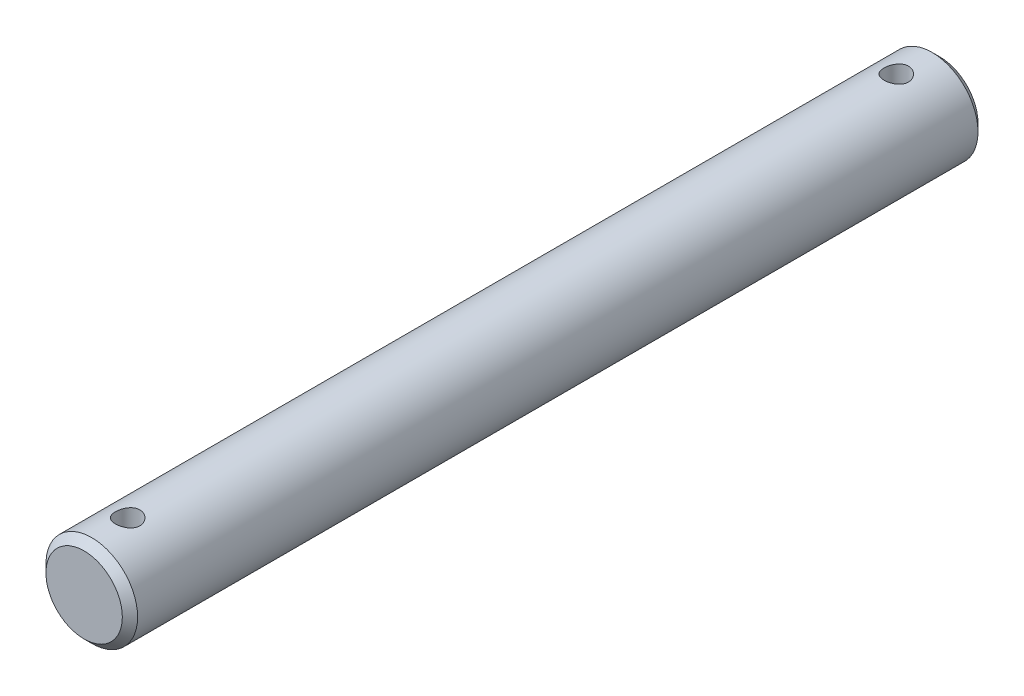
ISO-10303-21;
HEADER;
FILE_DESCRIPTION(('STEP AP214'),'2;1');
FILE_NAME('part.step','',(''),(''),'','','');
FILE_SCHEMA(('AUTOMOTIVE_DESIGN { 1 0 10303 214 1 1 1 1 }'));
ENDSEC;
DATA;
#1=APPLICATION_CONTEXT('core data for automotive mechanical design processes');
#2=APPLICATION_PROTOCOL_DEFINITION('international standard','automotive_design',2000,#1);
#3=PRODUCT_CONTEXT('',#1,'mechanical');
#4=PRODUCT('Part','Part','',(#3));
#5=PRODUCT_RELATED_PRODUCT_CATEGORY('part','',(#4));
#6=PRODUCT_DEFINITION_FORMATION('','',#4);
#7=PRODUCT_DEFINITION_CONTEXT('part definition',#1,'design');
#8=PRODUCT_DEFINITION('design','',#6,#7);
#9=PRODUCT_DEFINITION_SHAPE('','',#8);
#10=(LENGTH_UNIT() NAMED_UNIT(*) SI_UNIT(.MILLI.,.METRE.));
#11=(NAMED_UNIT(*) PLANE_ANGLE_UNIT() SI_UNIT($,.RADIAN.));
#12=(NAMED_UNIT(*) SI_UNIT($,.STERADIAN.) SOLID_ANGLE_UNIT());
#13=UNCERTAINTY_MEASURE_WITH_UNIT(LENGTH_MEASURE(1.E-05),#10,'distance_accuracy_value','');
#14=(GEOMETRIC_REPRESENTATION_CONTEXT(3) GLOBAL_UNCERTAINTY_ASSIGNED_CONTEXT((#13)) GLOBAL_UNIT_ASSIGNED_CONTEXT((#10,
#11,#12)) REPRESENTATION_CONTEXT('',''));
#15=CARTESIAN_POINT('',(0.,0.,0.));
#16=DIRECTION('',(0.,0.,1.));
#17=DIRECTION('',(1.,0.,0.));
#18=AXIS2_PLACEMENT_3D('',#15,#16,#17);
#19=CARTESIAN_POINT('',(0.,0.,28.));
#20=DIRECTION('',(0.,0.,-1.));
#21=DIRECTION('',(-1.,0.,0.));
#22=AXIS2_PLACEMENT_3D('',#19,#20,#21);
#23=CYLINDRICAL_SURFACE('',#22,3.);
#24=CARTESIAN_POINT('',(0.,-3.,25.95));
#25=CARTESIAN_POINT('',(0.0441018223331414,-2.99999933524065,25.9499989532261));
#26=CARTESIAN_POINT('',(0.0882148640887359,-2.99901794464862,25.9463409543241));
#27=CARTESIAN_POINT('',(0.175170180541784,-2.99519829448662,25.9318315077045));
#28=CARTESIAN_POINT('',(0.218011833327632,-2.99235914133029,25.9209765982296));
#29=CARTESIAN_POINT('',(0.301156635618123,-2.98513733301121,25.8924513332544));
#30=CARTESIAN_POINT('',(0.341462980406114,-2.98075666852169,25.8747897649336));
#31=CARTESIAN_POINT('',(0.418541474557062,-2.97091479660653,25.8331851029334));
#32=CARTESIAN_POINT('',(0.455313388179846,-2.96545351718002,25.8092415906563));
#33=CARTESIAN_POINT('',(0.525131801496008,-2.95389845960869,25.7551665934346));
#34=CARTESIAN_POINT('',(0.558084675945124,-2.9477938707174,25.7249165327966));
#35=CARTESIAN_POINT('',(0.618514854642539,-2.93570963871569,25.6593406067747));
#36=CARTESIAN_POINT('',(0.645991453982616,-2.92973001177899,25.6240140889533));
#37=CARTESIAN_POINT('',(0.695145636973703,-2.91846214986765,25.5485407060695));
#38=CARTESIAN_POINT('',(0.716715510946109,-2.91318755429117,25.5083214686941));
#39=CARTESIAN_POINT('',(0.752750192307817,-2.90408590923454,25.4246639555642));
#40=CARTESIAN_POINT('',(0.767216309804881,-2.9002585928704,25.3812262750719));
#41=CARTESIAN_POINT('',(0.788307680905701,-2.89459646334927,25.2934017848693));
#42=CARTESIAN_POINT('',(0.795102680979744,-2.89271859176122,25.2490585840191));
#43=CARTESIAN_POINT('',(0.801188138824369,-2.89103932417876,25.1598249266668));
#44=CARTESIAN_POINT('',(0.800479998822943,-2.89123754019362,25.1149345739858));
#45=CARTESIAN_POINT('',(0.791714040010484,-2.89364951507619,25.0272058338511));
#46=CARTESIAN_POINT('',(0.783861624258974,-2.89580694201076,24.9843451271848));
#47=CARTESIAN_POINT('',(0.761358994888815,-2.90180405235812,24.9005726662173));
#48=CARTESIAN_POINT('',(0.746708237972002,-2.90564387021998,24.8596610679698));
#49=CARTESIAN_POINT('',(0.710857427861,-2.91462264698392,24.7804127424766));
#50=CARTESIAN_POINT('',(0.68958536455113,-2.91977577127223,24.7421102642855));
#51=CARTESIAN_POINT('',(0.641146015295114,-2.93079291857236,24.6695463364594));
#52=CARTESIAN_POINT('',(0.613977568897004,-2.93665708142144,24.6352856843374));
#53=CARTESIAN_POINT('',(0.553466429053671,-2.94867004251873,24.5706044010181));
#54=CARTESIAN_POINT('',(0.519951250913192,-2.95482188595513,24.540345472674));
#55=CARTESIAN_POINT('',(0.448247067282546,-2.96654552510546,24.4858444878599));
#56=CARTESIAN_POINT('',(0.410057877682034,-2.97211729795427,24.461602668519));
#57=CARTESIAN_POINT('',(0.329839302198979,-2.98208728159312,24.4197528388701));
#58=CARTESIAN_POINT('',(0.287793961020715,-2.98648029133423,24.4021740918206));
#59=CARTESIAN_POINT('',(0.201200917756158,-2.99356017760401,24.3743811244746));
#60=CARTESIAN_POINT('',(0.156653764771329,-2.99624742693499,24.3641652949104));
#61=CARTESIAN_POINT('',(0.0677016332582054,-2.99955663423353,24.3516420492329));
#62=CARTESIAN_POINT('',(0.0233296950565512,-3.00023598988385,24.3491147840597));
#63=CARTESIAN_POINT('',(-0.0652040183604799,-2.99961788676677,24.3514332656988));
#64=CARTESIAN_POINT('',(-0.109365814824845,-2.99832063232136,24.3562782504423));
#65=CARTESIAN_POINT('',(-0.195440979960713,-2.99393214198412,24.373023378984));
#66=CARTESIAN_POINT('',(-0.237379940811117,-2.99087210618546,24.3848008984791));
#67=CARTESIAN_POINT('',(-0.318682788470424,-2.98330517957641,24.4149343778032));
#68=CARTESIAN_POINT('',(-0.3580463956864,-2.97879813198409,24.4332910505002));
#69=CARTESIAN_POINT('',(-0.433935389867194,-2.96870264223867,24.4764695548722));
#70=CARTESIAN_POINT('',(-0.47039007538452,-2.96309474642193,24.5014109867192));
#71=CARTESIAN_POINT('',(-0.538673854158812,-2.95144580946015,24.5569006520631));
#72=CARTESIAN_POINT('',(-0.570502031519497,-2.94540468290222,24.5874499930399));
#73=CARTESIAN_POINT('',(-0.629555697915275,-2.9333589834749,24.6543142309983));
#74=CARTESIAN_POINT('',(-0.656626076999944,-2.92736024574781,24.6907674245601));
#75=CARTESIAN_POINT('',(-0.704268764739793,-2.91626578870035,24.7678258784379));
#76=CARTESIAN_POINT('',(-0.724841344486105,-2.91117003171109,24.8084309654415));
#77=CARTESIAN_POINT('',(-0.758749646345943,-2.9025170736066,24.8924381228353));
#78=CARTESIAN_POINT('',(-0.772127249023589,-2.89895099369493,24.9358223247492));
#79=CARTESIAN_POINT('',(-0.791364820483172,-2.89375930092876,25.0243357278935));
#80=CARTESIAN_POINT('',(-0.797226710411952,-2.89213319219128,25.0694644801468));
#81=CARTESIAN_POINT('',(-0.801155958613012,-2.89104697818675,25.158597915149));
#82=CARTESIAN_POINT('',(-0.79947262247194,-2.89151759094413,25.2025909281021));
#83=CARTESIAN_POINT('',(-0.788937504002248,-2.89440958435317,25.2896414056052));
#84=CARTESIAN_POINT('',(-0.780085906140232,-2.89683091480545,25.3326988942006));
#85=CARTESIAN_POINT('',(-0.755610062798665,-2.90331028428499,25.4163423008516));
#86=CARTESIAN_POINT('',(-0.740038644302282,-2.90735554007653,25.4569447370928));
#87=CARTESIAN_POINT('',(-0.702606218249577,-2.91662727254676,25.5349915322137));
#88=CARTESIAN_POINT('',(-0.680744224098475,-2.92185393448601,25.5724353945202));
#89=CARTESIAN_POINT('',(-0.630595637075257,-2.93309168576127,25.6442921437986));
#90=CARTESIAN_POINT('',(-0.602138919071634,-2.93912133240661,25.6785834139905));
#91=CARTESIAN_POINT('',(-0.539932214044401,-2.95118201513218,25.7419849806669));
#92=CARTESIAN_POINT('',(-0.506180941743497,-2.9572130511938,25.7710940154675));
#93=CARTESIAN_POINT('',(-0.433471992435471,-2.96875124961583,25.8239168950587));
#94=CARTESIAN_POINT('',(-0.39441838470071,-2.97424444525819,25.8475020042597));
#95=CARTESIAN_POINT('',(-0.312755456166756,-2.9839352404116,25.8877349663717));
#96=CARTESIAN_POINT('',(-0.270148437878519,-2.98813367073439,25.9043872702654));
#97=CARTESIAN_POINT('',(-0.189749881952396,-2.99421901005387,25.9281101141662));
#98=CARTESIAN_POINT('',(-0.152304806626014,-2.99637108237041,25.936299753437));
#99=CARTESIAN_POINT('',(-0.0765759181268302,-2.99926179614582,25.9472448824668));
#100=CARTESIAN_POINT('',(-0.0382921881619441,-3.00000057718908,25.95000090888));
#101=CARTESIAN_POINT('',(0.,-3.,25.95));
#102=B_SPLINE_CURVE_WITH_KNOTS('',3,(#24,#25,#26,#27,#28,#29,#30,#31,#32,#33,#34,#35,#36,#37,
#38,#39,#40,#41,#42,#43,#44,#45,#46,#47,#48,#49,#50,#51,#52,#53,#54,#55,#56,#57,#58,#59,#60,#61,
#62,#63,#64,#65,#66,#67,#68,#69,#70,#71,#72,#73,#74,#75,#76,#77,#78,#79,#80,#81,#82,#83,#84,#85,
#86,#87,#88,#89,#90,#91,#92,#93,#94,#95,#96,#97,#98,#99,#100,#101),.UNSPECIFIED.,.T.,.F.,(4,2,2,
2,2,2,2,2,2,2,2,2,2,2,2,2,2,2,2,2,2,2,2,2,2,2,2,2,2,2,2,2,2,2,2,2,2,2,4),(0.,0.132165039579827,
0.264393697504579,0.396452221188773,0.528519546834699,0.663339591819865,0.798176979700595,
0.935330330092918,1.0724583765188,1.20648863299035,1.34049384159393,1.47076400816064,
1.60104458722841,1.73279469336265,1.86457075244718,2.00064503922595,2.13672468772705,
2.27339523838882,2.41003590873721,2.54273087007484,2.67541211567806,2.80581414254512,
2.93623030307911,3.06920114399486,3.2021982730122,3.33894598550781,3.47568799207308,
3.61162519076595,3.7475276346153,3.87897336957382,4.01041572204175,4.14084306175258,
4.27129086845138,4.40557735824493,4.53989649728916,4.67708900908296,4.81419330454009,
4.92895927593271,5.0437139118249),.UNSPECIFIED.);
#103=CARTESIAN_POINT('',(0.,-3.,25.95));
#104=VERTEX_POINT('',#103);
#105=EDGE_CURVE('E10',#104,#104,#102,.T.);
#106=ORIENTED_EDGE('',*,*,#105,.T.);
#107=EDGE_LOOP('',(#106));
#108=FACE_BOUND('',#107,.T.);
#109=CARTESIAN_POINT('',(0.,3.,25.95));
#110=CARTESIAN_POINT('',(-0.0441018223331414,2.99999933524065,25.9499989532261));
#111=CARTESIAN_POINT('',(-0.0882148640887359,2.99901794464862,25.9463409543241));
#112=CARTESIAN_POINT('',(-0.175170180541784,2.99519829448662,25.9318315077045));
#113=CARTESIAN_POINT('',(-0.218011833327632,2.99235914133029,25.9209765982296));
#114=CARTESIAN_POINT('',(-0.301156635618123,2.98513733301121,25.8924513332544));
#115=CARTESIAN_POINT('',(-0.341462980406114,2.98075666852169,25.8747897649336));
#116=CARTESIAN_POINT('',(-0.418541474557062,2.97091479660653,25.8331851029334));
#117=CARTESIAN_POINT('',(-0.455313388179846,2.96545351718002,25.8092415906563));
#118=CARTESIAN_POINT('',(-0.525131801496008,2.95389845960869,25.7551665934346));
#119=CARTESIAN_POINT('',(-0.558084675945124,2.9477938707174,25.7249165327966));
#120=CARTESIAN_POINT('',(-0.618514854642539,2.93570963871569,25.6593406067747));
#121=CARTESIAN_POINT('',(-0.645991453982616,2.92973001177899,25.6240140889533));
#122=CARTESIAN_POINT('',(-0.695145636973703,2.91846214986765,25.5485407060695));
#123=CARTESIAN_POINT('',(-0.716715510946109,2.91318755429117,25.5083214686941));
#124=CARTESIAN_POINT('',(-0.752750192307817,2.90408590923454,25.4246639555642));
#125=CARTESIAN_POINT('',(-0.767216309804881,2.9002585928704,25.3812262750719));
#126=CARTESIAN_POINT('',(-0.788307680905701,2.89459646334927,25.2934017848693));
#127=CARTESIAN_POINT('',(-0.795102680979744,2.89271859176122,25.2490585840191));
#128=CARTESIAN_POINT('',(-0.801188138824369,2.89103932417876,25.1598249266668));
#129=CARTESIAN_POINT('',(-0.800479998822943,2.89123754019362,25.1149345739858));
#130=CARTESIAN_POINT('',(-0.791714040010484,2.89364951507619,25.0272058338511));
#131=CARTESIAN_POINT('',(-0.783861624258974,2.89580694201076,24.9843451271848));
#132=CARTESIAN_POINT('',(-0.761358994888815,2.90180405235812,24.9005726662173));
#133=CARTESIAN_POINT('',(-0.746708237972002,2.90564387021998,24.8596610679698));
#134=CARTESIAN_POINT('',(-0.710857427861,2.91462264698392,24.7804127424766));
#135=CARTESIAN_POINT('',(-0.68958536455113,2.91977577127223,24.7421102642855));
#136=CARTESIAN_POINT('',(-0.641146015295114,2.93079291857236,24.6695463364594));
#137=CARTESIAN_POINT('',(-0.613977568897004,2.93665708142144,24.6352856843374));
#138=CARTESIAN_POINT('',(-0.553466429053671,2.94867004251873,24.5706044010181));
#139=CARTESIAN_POINT('',(-0.519951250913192,2.95482188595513,24.540345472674));
#140=CARTESIAN_POINT('',(-0.448247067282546,2.96654552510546,24.4858444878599));
#141=CARTESIAN_POINT('',(-0.410057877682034,2.97211729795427,24.461602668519));
#142=CARTESIAN_POINT('',(-0.329839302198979,2.98208728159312,24.4197528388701));
#143=CARTESIAN_POINT('',(-0.287793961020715,2.98648029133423,24.4021740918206));
#144=CARTESIAN_POINT('',(-0.201200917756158,2.99356017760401,24.3743811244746));
#145=CARTESIAN_POINT('',(-0.156653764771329,2.99624742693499,24.3641652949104));
#146=CARTESIAN_POINT('',(-0.0677016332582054,2.99955663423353,24.3516420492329));
#147=CARTESIAN_POINT('',(-0.0233296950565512,3.00023598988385,24.3491147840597));
#148=CARTESIAN_POINT('',(0.0652040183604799,2.99961788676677,24.3514332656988));
#149=CARTESIAN_POINT('',(0.109365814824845,2.99832063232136,24.3562782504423));
#150=CARTESIAN_POINT('',(0.195440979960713,2.99393214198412,24.373023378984));
#151=CARTESIAN_POINT('',(0.237379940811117,2.99087210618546,24.3848008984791));
#152=CARTESIAN_POINT('',(0.318682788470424,2.98330517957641,24.4149343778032));
#153=CARTESIAN_POINT('',(0.3580463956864,2.97879813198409,24.4332910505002));
#154=CARTESIAN_POINT('',(0.433935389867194,2.96870264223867,24.4764695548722));
#155=CARTESIAN_POINT('',(0.47039007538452,2.96309474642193,24.5014109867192));
#156=CARTESIAN_POINT('',(0.538673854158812,2.95144580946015,24.5569006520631));
#157=CARTESIAN_POINT('',(0.570502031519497,2.94540468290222,24.5874499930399));
#158=CARTESIAN_POINT('',(0.629555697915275,2.9333589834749,24.6543142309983));
#159=CARTESIAN_POINT('',(0.656626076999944,2.92736024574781,24.6907674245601));
#160=CARTESIAN_POINT('',(0.704268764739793,2.91626578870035,24.7678258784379));
#161=CARTESIAN_POINT('',(0.724841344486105,2.91117003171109,24.8084309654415));
#162=CARTESIAN_POINT('',(0.758749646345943,2.9025170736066,24.8924381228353));
#163=CARTESIAN_POINT('',(0.772127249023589,2.89895099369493,24.9358223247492));
#164=CARTESIAN_POINT('',(0.791364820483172,2.89375930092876,25.0243357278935));
#165=CARTESIAN_POINT('',(0.797226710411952,2.89213319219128,25.0694644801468));
#166=CARTESIAN_POINT('',(0.801155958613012,2.89104697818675,25.158597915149));
#167=CARTESIAN_POINT('',(0.79947262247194,2.89151759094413,25.2025909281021));
#168=CARTESIAN_POINT('',(0.788937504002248,2.89440958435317,25.2896414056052));
#169=CARTESIAN_POINT('',(0.780085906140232,2.89683091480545,25.3326988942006));
#170=CARTESIAN_POINT('',(0.755610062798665,2.90331028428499,25.4163423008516));
#171=CARTESIAN_POINT('',(0.740038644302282,2.90735554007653,25.4569447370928));
#172=CARTESIAN_POINT('',(0.702606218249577,2.91662727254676,25.5349915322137));
#173=CARTESIAN_POINT('',(0.680744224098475,2.92185393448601,25.5724353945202));
#174=CARTESIAN_POINT('',(0.630595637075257,2.93309168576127,25.6442921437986));
#175=CARTESIAN_POINT('',(0.602138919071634,2.93912133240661,25.6785834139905));
#176=CARTESIAN_POINT('',(0.539932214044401,2.95118201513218,25.7419849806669));
#177=CARTESIAN_POINT('',(0.506180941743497,2.9572130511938,25.7710940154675));
#178=CARTESIAN_POINT('',(0.433471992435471,2.96875124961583,25.8239168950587));
#179=CARTESIAN_POINT('',(0.39441838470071,2.97424444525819,25.8475020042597));
#180=CARTESIAN_POINT('',(0.312755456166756,2.9839352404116,25.8877349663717));
#181=CARTESIAN_POINT('',(0.270148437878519,2.98813367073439,25.9043872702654));
#182=CARTESIAN_POINT('',(0.189749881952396,2.99421901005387,25.9281101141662));
#183=CARTESIAN_POINT('',(0.152304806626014,2.99637108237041,25.936299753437));
#184=CARTESIAN_POINT('',(0.0765759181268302,2.99926179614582,25.9472448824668));
#185=CARTESIAN_POINT('',(0.0382921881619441,3.00000057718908,25.95000090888));
#186=CARTESIAN_POINT('',(0.,3.,25.95));
#187=B_SPLINE_CURVE_WITH_KNOTS('',3,(#109,#110,#111,#112,#113,#114,#115,#116,#117,#118,#119,
#120,#121,#122,#123,#124,#125,#126,#127,#128,#129,#130,#131,#132,#133,#134,#135,#136,#137,#138,
#139,#140,#141,#142,#143,#144,#145,#146,#147,#148,#149,#150,#151,#152,#153,#154,#155,#156,#157,
#158,#159,#160,#161,#162,#163,#164,#165,#166,#167,#168,#169,#170,#171,#172,#173,#174,#175,#176,
#177,#178,#179,#180,#181,#182,#183,#184,#185,#186),.UNSPECIFIED.,.T.,.F.,(4,2,2,2,2,2,2,2,2,2,2,
2,2,2,2,2,2,2,2,2,2,2,2,2,2,2,2,2,2,2,2,2,2,2,2,2,2,2,4),(0.,0.132165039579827,
0.264393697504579,0.396452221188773,0.528519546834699,0.663339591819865,0.798176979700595,
0.935330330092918,1.0724583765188,1.20648863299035,1.34049384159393,1.47076400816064,
1.60104458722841,1.73279469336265,1.86457075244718,2.00064503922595,2.13672468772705,
2.27339523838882,2.41003590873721,2.54273087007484,2.67541211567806,2.80581414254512,
2.93623030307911,3.06920114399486,3.2021982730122,3.33894598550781,3.47568799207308,
3.61162519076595,3.7475276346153,3.87897336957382,4.01041572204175,4.14084306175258,
4.27129086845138,4.40557735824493,4.53989649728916,4.67708900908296,4.81419330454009,
4.92895927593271,5.0437139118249),.UNSPECIFIED.);
#188=CARTESIAN_POINT('',(0.,3.,25.95));
#189=VERTEX_POINT('',#188);
#190=EDGE_CURVE('E41',#189,#189,#187,.T.);
#191=ORIENTED_EDGE('',*,*,#190,.T.);
#192=EDGE_LOOP('',(#191));
#193=FACE_BOUND('',#192,.T.);
#194=CARTESIAN_POINT('',(0.,-3.,-24.35));
#195=CARTESIAN_POINT('',(0.0441018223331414,-2.99999933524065,-24.3500010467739));
#196=CARTESIAN_POINT('',(0.0882148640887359,-2.99901794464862,-24.3536590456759));
#197=CARTESIAN_POINT('',(0.175170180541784,-2.99519829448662,-24.3681684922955));
#198=CARTESIAN_POINT('',(0.218011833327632,-2.99235914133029,-24.3790234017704));
#199=CARTESIAN_POINT('',(0.301156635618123,-2.98513733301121,-24.4075486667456));
#200=CARTESIAN_POINT('',(0.341462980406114,-2.98075666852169,-24.4252102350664));
#201=CARTESIAN_POINT('',(0.418541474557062,-2.97091479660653,-24.4668148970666));
#202=CARTESIAN_POINT('',(0.455313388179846,-2.96545351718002,-24.4907584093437));
#203=CARTESIAN_POINT('',(0.525131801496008,-2.95389845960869,-24.5448334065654));
#204=CARTESIAN_POINT('',(0.558084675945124,-2.9477938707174,-24.5750834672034));
#205=CARTESIAN_POINT('',(0.618514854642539,-2.93570963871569,-24.6406593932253));
#206=CARTESIAN_POINT('',(0.645991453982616,-2.92973001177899,-24.6759859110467));
#207=CARTESIAN_POINT('',(0.695145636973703,-2.91846214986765,-24.7514592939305));
#208=CARTESIAN_POINT('',(0.716715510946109,-2.91318755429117,-24.7916785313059));
#209=CARTESIAN_POINT('',(0.752750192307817,-2.90408590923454,-24.8753360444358));
#210=CARTESIAN_POINT('',(0.767216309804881,-2.9002585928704,-24.9187737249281));
#211=CARTESIAN_POINT('',(0.788307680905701,-2.89459646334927,-25.0065982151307));
#212=CARTESIAN_POINT('',(0.795102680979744,-2.89271859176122,-25.0509414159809));
#213=CARTESIAN_POINT('',(0.801188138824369,-2.89103932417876,-25.1401750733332));
#214=CARTESIAN_POINT('',(0.800479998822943,-2.89123754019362,-25.1850654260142));
#215=CARTESIAN_POINT('',(0.791714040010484,-2.89364951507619,-25.2727941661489));
#216=CARTESIAN_POINT('',(0.783861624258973,-2.89580694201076,-25.3156548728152));
#217=CARTESIAN_POINT('',(0.761358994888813,-2.90180405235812,-25.3994273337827));
#218=CARTESIAN_POINT('',(0.746708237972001,-2.90564387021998,-25.4403389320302));
#219=CARTESIAN_POINT('',(0.710857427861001,-2.91462264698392,-25.5195872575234));
#220=CARTESIAN_POINT('',(0.68958536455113,-2.91977577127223,-25.5578897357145));
#221=CARTESIAN_POINT('',(0.641146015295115,-2.93079291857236,-25.6304536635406));
#222=CARTESIAN_POINT('',(0.613977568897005,-2.93665708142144,-25.6647143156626));
#223=CARTESIAN_POINT('',(0.553466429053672,-2.94867004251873,-25.7293955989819));
#224=CARTESIAN_POINT('',(0.519951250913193,-2.95482188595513,-25.759654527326));
#225=CARTESIAN_POINT('',(0.448247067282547,-2.96654552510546,-25.8141555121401));
#226=CARTESIAN_POINT('',(0.410057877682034,-2.97211729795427,-25.838397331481));
#227=CARTESIAN_POINT('',(0.329839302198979,-2.98208728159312,-25.8802471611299));
#228=CARTESIAN_POINT('',(0.287793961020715,-2.98648029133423,-25.8978259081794));
#229=CARTESIAN_POINT('',(0.201200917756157,-2.99356017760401,-25.9256188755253));
#230=CARTESIAN_POINT('',(0.156653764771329,-2.99624742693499,-25.9358347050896));
#231=CARTESIAN_POINT('',(0.0677016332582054,-2.99955663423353,-25.9483579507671));
#232=CARTESIAN_POINT('',(0.0233296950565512,-3.00023598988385,-25.9508852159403));
#233=CARTESIAN_POINT('',(-0.0652040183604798,-2.99961788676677,-25.9485667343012));
#234=CARTESIAN_POINT('',(-0.109365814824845,-2.99832063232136,-25.9437217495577));
#235=CARTESIAN_POINT('',(-0.195440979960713,-2.99393214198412,-25.926976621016));
#236=CARTESIAN_POINT('',(-0.237379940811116,-2.99087210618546,-25.9151991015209));
#237=CARTESIAN_POINT('',(-0.318682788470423,-2.98330517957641,-25.8850656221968));
#238=CARTESIAN_POINT('',(-0.3580463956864,-2.97879813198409,-25.8667089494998));
#239=CARTESIAN_POINT('',(-0.433935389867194,-2.96870264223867,-25.8235304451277));
#240=CARTESIAN_POINT('',(-0.47039007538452,-2.96309474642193,-25.7985890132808));
#241=CARTESIAN_POINT('',(-0.538673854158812,-2.95144580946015,-25.7430993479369));
#242=CARTESIAN_POINT('',(-0.570502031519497,-2.94540468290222,-25.7125500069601));
#243=CARTESIAN_POINT('',(-0.629555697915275,-2.9333589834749,-25.6456857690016));
#244=CARTESIAN_POINT('',(-0.656626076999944,-2.92736024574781,-25.6092325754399));
#245=CARTESIAN_POINT('',(-0.704268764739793,-2.91626578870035,-25.5321741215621));
#246=CARTESIAN_POINT('',(-0.724841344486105,-2.91117003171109,-25.4915690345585));
#247=CARTESIAN_POINT('',(-0.758749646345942,-2.9025170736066,-25.4075618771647));
#248=CARTESIAN_POINT('',(-0.772127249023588,-2.89895099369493,-25.3641776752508));
#249=CARTESIAN_POINT('',(-0.791364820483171,-2.89375930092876,-25.2756642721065));
#250=CARTESIAN_POINT('',(-0.797226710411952,-2.89213319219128,-25.2305355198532));
#251=CARTESIAN_POINT('',(-0.801155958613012,-2.89104697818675,-25.141402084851));
#252=CARTESIAN_POINT('',(-0.799472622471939,-2.89151759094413,-25.0974090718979));
#253=CARTESIAN_POINT('',(-0.788937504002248,-2.89440958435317,-25.0103585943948));
#254=CARTESIAN_POINT('',(-0.780085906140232,-2.89683091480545,-24.9673011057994));
#255=CARTESIAN_POINT('',(-0.755610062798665,-2.90331028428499,-24.8836576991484));
#256=CARTESIAN_POINT('',(-0.740038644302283,-2.90735554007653,-24.8430552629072));
#257=CARTESIAN_POINT('',(-0.702606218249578,-2.91662727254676,-24.7650084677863));
#258=CARTESIAN_POINT('',(-0.680744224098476,-2.92185393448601,-24.7275646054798));
#259=CARTESIAN_POINT('',(-0.630595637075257,-2.93309168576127,-24.6557078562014));
#260=CARTESIAN_POINT('',(-0.602138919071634,-2.93912133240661,-24.6214165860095));
#261=CARTESIAN_POINT('',(-0.539932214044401,-2.95118201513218,-24.5580150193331));
#262=CARTESIAN_POINT('',(-0.506180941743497,-2.9572130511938,-24.5289059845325));
#263=CARTESIAN_POINT('',(-0.433471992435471,-2.96875124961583,-24.4760831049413));
#264=CARTESIAN_POINT('',(-0.39441838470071,-2.97424444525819,-24.4524979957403));
#265=CARTESIAN_POINT('',(-0.312755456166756,-2.9839352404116,-24.4122650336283));
#266=CARTESIAN_POINT('',(-0.270148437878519,-2.98813367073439,-24.3956127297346));
#267=CARTESIAN_POINT('',(-0.189749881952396,-2.99421901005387,-24.3718898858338));
#268=CARTESIAN_POINT('',(-0.152304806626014,-2.99637108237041,-24.363700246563));
#269=CARTESIAN_POINT('',(-0.0765759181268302,-2.99926179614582,-24.3527551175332));
#270=CARTESIAN_POINT('',(-0.0382921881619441,-3.00000057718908,-24.34999909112));
#271=CARTESIAN_POINT('',(0.,-3.,-24.35));
#272=B_SPLINE_CURVE_WITH_KNOTS('',3,(#194,#195,#196,#197,#198,#199,#200,#201,#202,#203,#204,
#205,#206,#207,#208,#209,#210,#211,#212,#213,#214,#215,#216,#217,#218,#219,#220,#221,#222,#223,
#224,#225,#226,#227,#228,#229,#230,#231,#232,#233,#234,#235,#236,#237,#238,#239,#240,#241,#242,
#243,#244,#245,#246,#247,#248,#249,#250,#251,#252,#253,#254,#255,#256,#257,#258,#259,#260,#261,
#262,#263,#264,#265,#266,#267,#268,#269,#270,#271),.UNSPECIFIED.,.T.,.F.,(4,2,2,2,2,2,2,2,2,2,2,
2,2,2,2,2,2,2,2,2,2,2,2,2,2,2,2,2,2,2,2,2,2,2,2,2,2,2,4),(0.,0.132165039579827,
0.264393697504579,0.396452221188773,0.528519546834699,0.663339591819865,0.798176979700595,
0.935330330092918,1.0724583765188,1.20648863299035,1.34049384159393,1.47076400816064,
1.60104458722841,1.73279469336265,1.86457075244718,2.00064503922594,2.13672468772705,
2.27339523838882,2.41003590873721,2.54273087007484,2.67541211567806,2.80581414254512,
2.93623030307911,3.06920114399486,3.2021982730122,3.33894598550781,3.47568799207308,
3.61162519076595,3.7475276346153,3.87897336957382,4.01041572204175,4.14084306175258,
4.27129086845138,4.40557735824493,4.53989649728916,4.67708900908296,4.81419330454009,
4.92895927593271,5.0437139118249),.UNSPECIFIED.);
#273=CARTESIAN_POINT('',(0.,-3.,-24.35));
#274=VERTEX_POINT('',#273);
#275=EDGE_CURVE('E45',#274,#274,#272,.T.);
#276=ORIENTED_EDGE('',*,*,#275,.T.);
#277=EDGE_LOOP('',(#276));
#278=FACE_BOUND('',#277,.T.);
#279=CARTESIAN_POINT('',(0.,3.,-24.35));
#280=CARTESIAN_POINT('',(-0.0441018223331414,2.99999933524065,-24.3500010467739));
#281=CARTESIAN_POINT('',(-0.0882148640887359,2.99901794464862,-24.3536590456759));
#282=CARTESIAN_POINT('',(-0.175170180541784,2.99519829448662,-24.3681684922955));
#283=CARTESIAN_POINT('',(-0.218011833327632,2.99235914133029,-24.3790234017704));
#284=CARTESIAN_POINT('',(-0.301156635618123,2.98513733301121,-24.4075486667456));
#285=CARTESIAN_POINT('',(-0.341462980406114,2.98075666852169,-24.4252102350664));
#286=CARTESIAN_POINT('',(-0.418541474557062,2.97091479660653,-24.4668148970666));
#287=CARTESIAN_POINT('',(-0.455313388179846,2.96545351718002,-24.4907584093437));
#288=CARTESIAN_POINT('',(-0.525131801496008,2.95389845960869,-24.5448334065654));
#289=CARTESIAN_POINT('',(-0.558084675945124,2.9477938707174,-24.5750834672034));
#290=CARTESIAN_POINT('',(-0.618514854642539,2.93570963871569,-24.6406593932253));
#291=CARTESIAN_POINT('',(-0.645991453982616,2.92973001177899,-24.6759859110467));
#292=CARTESIAN_POINT('',(-0.695145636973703,2.91846214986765,-24.7514592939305));
#293=CARTESIAN_POINT('',(-0.716715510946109,2.91318755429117,-24.7916785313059));
#294=CARTESIAN_POINT('',(-0.752750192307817,2.90408590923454,-24.8753360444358));
#295=CARTESIAN_POINT('',(-0.767216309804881,2.9002585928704,-24.9187737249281));
#296=CARTESIAN_POINT('',(-0.788307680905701,2.89459646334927,-25.0065982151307));
#297=CARTESIAN_POINT('',(-0.795102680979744,2.89271859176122,-25.0509414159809));
#298=CARTESIAN_POINT('',(-0.801188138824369,2.89103932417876,-25.1401750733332));
#299=CARTESIAN_POINT('',(-0.800479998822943,2.89123754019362,-25.1850654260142));
#300=CARTESIAN_POINT('',(-0.791714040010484,2.89364951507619,-25.2727941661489));
#301=CARTESIAN_POINT('',(-0.783861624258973,2.89580694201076,-25.3156548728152));
#302=CARTESIAN_POINT('',(-0.761358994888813,2.90180405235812,-25.3994273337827));
#303=CARTESIAN_POINT('',(-0.746708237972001,2.90564387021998,-25.4403389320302));
#304=CARTESIAN_POINT('',(-0.710857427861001,2.91462264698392,-25.5195872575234));
#305=CARTESIAN_POINT('',(-0.68958536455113,2.91977577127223,-25.5578897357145));
#306=CARTESIAN_POINT('',(-0.641146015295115,2.93079291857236,-25.6304536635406));
#307=CARTESIAN_POINT('',(-0.613977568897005,2.93665708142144,-25.6647143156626));
#308=CARTESIAN_POINT('',(-0.553466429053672,2.94867004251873,-25.7293955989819));
#309=CARTESIAN_POINT('',(-0.519951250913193,2.95482188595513,-25.759654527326));
#310=CARTESIAN_POINT('',(-0.448247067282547,2.96654552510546,-25.8141555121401));
#311=CARTESIAN_POINT('',(-0.410057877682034,2.97211729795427,-25.838397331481));
#312=CARTESIAN_POINT('',(-0.329839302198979,2.98208728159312,-25.8802471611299));
#313=CARTESIAN_POINT('',(-0.287793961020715,2.98648029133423,-25.8978259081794));
#314=CARTESIAN_POINT('',(-0.201200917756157,2.99356017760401,-25.9256188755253));
#315=CARTESIAN_POINT('',(-0.156653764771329,2.99624742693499,-25.9358347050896));
#316=CARTESIAN_POINT('',(-0.0677016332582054,2.99955663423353,-25.9483579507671));
#317=CARTESIAN_POINT('',(-0.0233296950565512,3.00023598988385,-25.9508852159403));
#318=CARTESIAN_POINT('',(0.0652040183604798,2.99961788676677,-25.9485667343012));
#319=CARTESIAN_POINT('',(0.109365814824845,2.99832063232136,-25.9437217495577));
#320=CARTESIAN_POINT('',(0.195440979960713,2.99393214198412,-25.926976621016));
#321=CARTESIAN_POINT('',(0.237379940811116,2.99087210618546,-25.9151991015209));
#322=CARTESIAN_POINT('',(0.318682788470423,2.98330517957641,-25.8850656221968));
#323=CARTESIAN_POINT('',(0.3580463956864,2.97879813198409,-25.8667089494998));
#324=CARTESIAN_POINT('',(0.433935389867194,2.96870264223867,-25.8235304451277));
#325=CARTESIAN_POINT('',(0.47039007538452,2.96309474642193,-25.7985890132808));
#326=CARTESIAN_POINT('',(0.538673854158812,2.95144580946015,-25.7430993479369));
#327=CARTESIAN_POINT('',(0.570502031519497,2.94540468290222,-25.7125500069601));
#328=CARTESIAN_POINT('',(0.629555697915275,2.9333589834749,-25.6456857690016));
#329=CARTESIAN_POINT('',(0.656626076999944,2.92736024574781,-25.6092325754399));
#330=CARTESIAN_POINT('',(0.704268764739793,2.91626578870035,-25.5321741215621));
#331=CARTESIAN_POINT('',(0.724841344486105,2.91117003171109,-25.4915690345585));
#332=CARTESIAN_POINT('',(0.758749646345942,2.9025170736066,-25.4075618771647));
#333=CARTESIAN_POINT('',(0.772127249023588,2.89895099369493,-25.3641776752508));
#334=CARTESIAN_POINT('',(0.791364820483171,2.89375930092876,-25.2756642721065));
#335=CARTESIAN_POINT('',(0.797226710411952,2.89213319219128,-25.2305355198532));
#336=CARTESIAN_POINT('',(0.801155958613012,2.89104697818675,-25.141402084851));
#337=CARTESIAN_POINT('',(0.799472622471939,2.89151759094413,-25.0974090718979));
#338=CARTESIAN_POINT('',(0.788937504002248,2.89440958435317,-25.0103585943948));
#339=CARTESIAN_POINT('',(0.780085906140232,2.89683091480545,-24.9673011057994));
#340=CARTESIAN_POINT('',(0.755610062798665,2.90331028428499,-24.8836576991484));
#341=CARTESIAN_POINT('',(0.740038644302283,2.90735554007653,-24.8430552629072));
#342=CARTESIAN_POINT('',(0.702606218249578,2.91662727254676,-24.7650084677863));
#343=CARTESIAN_POINT('',(0.680744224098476,2.92185393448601,-24.7275646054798));
#344=CARTESIAN_POINT('',(0.630595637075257,2.93309168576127,-24.6557078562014));
#345=CARTESIAN_POINT('',(0.602138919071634,2.93912133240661,-24.6214165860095));
#346=CARTESIAN_POINT('',(0.539932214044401,2.95118201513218,-24.5580150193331));
#347=CARTESIAN_POINT('',(0.506180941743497,2.9572130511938,-24.5289059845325));
#348=CARTESIAN_POINT('',(0.433471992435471,2.96875124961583,-24.4760831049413));
#349=CARTESIAN_POINT('',(0.39441838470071,2.97424444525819,-24.4524979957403));
#350=CARTESIAN_POINT('',(0.312755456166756,2.9839352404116,-24.4122650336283));
#351=CARTESIAN_POINT('',(0.270148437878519,2.98813367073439,-24.3956127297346));
#352=CARTESIAN_POINT('',(0.189749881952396,2.99421901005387,-24.3718898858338));
#353=CARTESIAN_POINT('',(0.152304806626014,2.99637108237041,-24.363700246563));
#354=CARTESIAN_POINT('',(0.0765759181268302,2.99926179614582,-24.3527551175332));
#355=CARTESIAN_POINT('',(0.0382921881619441,3.00000057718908,-24.34999909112));
#356=CARTESIAN_POINT('',(0.,3.,-24.35));
#357=B_SPLINE_CURVE_WITH_KNOTS('',3,(#279,#280,#281,#282,#283,#284,#285,#286,#287,#288,#289,
#290,#291,#292,#293,#294,#295,#296,#297,#298,#299,#300,#301,#302,#303,#304,#305,#306,#307,#308,
#309,#310,#311,#312,#313,#314,#315,#316,#317,#318,#319,#320,#321,#322,#323,#324,#325,#326,#327,
#328,#329,#330,#331,#332,#333,#334,#335,#336,#337,#338,#339,#340,#341,#342,#343,#344,#345,#346,
#347,#348,#349,#350,#351,#352,#353,#354,#355,#356),.UNSPECIFIED.,.T.,.F.,(4,2,2,2,2,2,2,2,2,2,2,
2,2,2,2,2,2,2,2,2,2,2,2,2,2,2,2,2,2,2,2,2,2,2,2,2,2,2,4),(0.,0.132165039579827,
0.264393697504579,0.396452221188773,0.528519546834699,0.663339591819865,0.798176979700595,
0.935330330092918,1.0724583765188,1.20648863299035,1.34049384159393,1.47076400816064,
1.60104458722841,1.73279469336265,1.86457075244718,2.00064503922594,2.13672468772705,
2.27339523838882,2.41003590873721,2.54273087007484,2.67541211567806,2.80581414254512,
2.93623030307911,3.06920114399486,3.2021982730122,3.33894598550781,3.47568799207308,
3.61162519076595,3.7475276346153,3.87897336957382,4.01041572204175,4.14084306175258,
4.27129086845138,4.40557735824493,4.53989649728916,4.67708900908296,4.81419330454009,
4.92895927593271,5.0437139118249),.UNSPECIFIED.);
#358=CARTESIAN_POINT('',(0.,3.,-24.35));
#359=VERTEX_POINT('',#358);
#360=EDGE_CURVE('E49',#359,#359,#357,.T.);
#361=ORIENTED_EDGE('',*,*,#360,.T.);
#362=EDGE_LOOP('',(#361));
#363=FACE_BOUND('',#362,.T.);
#364=CARTESIAN_POINT('',(0.,0.,-27.5));
#365=DIRECTION('',(0.,0.,1.));
#366=DIRECTION('',(1.,0.,0.));
#367=AXIS2_PLACEMENT_3D('',#364,#365,#366);
#368=CIRCLE('',#367,3.);
#369=CARTESIAN_POINT('',(3.,0.,-27.5));
#370=VERTEX_POINT('',#369);
#371=EDGE_CURVE('E81',#370,#370,#368,.T.);
#372=ORIENTED_EDGE('',*,*,#371,.T.);
#373=EDGE_LOOP('',(#372));
#374=FACE_BOUND('',#373,.T.);
#375=CARTESIAN_POINT('',(0.,0.,27.5));
#376=DIRECTION('',(0.,0.,1.));
#377=DIRECTION('',(1.,0.,0.));
#378=AXIS2_PLACEMENT_3D('',#375,#376,#377);
#379=CIRCLE('',#378,3.);
#380=CARTESIAN_POINT('',(3.,0.,27.5));
#381=VERTEX_POINT('',#380);
#382=EDGE_CURVE('E84',#381,#381,#379,.F.);
#383=ORIENTED_EDGE('',*,*,#382,.T.);
#384=EDGE_LOOP('',(#383));
#385=FACE_BOUND('',#384,.T.);
#386=ADVANCED_FACE('F30',(#108,#193,#278,#363,#374,#385),#23,.T.);
#387=CARTESIAN_POINT('',(0.,0.,28.));
#388=DIRECTION('',(0.,0.,1.));
#389=DIRECTION('',(1.,0.,0.));
#390=AXIS2_PLACEMENT_3D('',#387,#388,#389);
#391=PLANE('',#390);
#392=CARTESIAN_POINT('',(0.,0.,28.));
#393=DIRECTION('',(0.,0.,1.));
#394=DIRECTION('',(1.,0.,0.));
#395=AXIS2_PLACEMENT_3D('',#392,#393,#394);
#396=CIRCLE('',#395,2.5);
#397=CARTESIAN_POINT('',(2.5,0.,28.));
#398=VERTEX_POINT('',#397);
#399=EDGE_CURVE('E75',#398,#398,#396,.T.);
#400=ORIENTED_EDGE('',*,*,#399,.T.);
#401=EDGE_LOOP('',(#400));
#402=FACE_BOUND('',#401,.T.);
#403=ADVANCED_FACE('F69',(#402),#391,.T.);
#404=CARTESIAN_POINT('',(0.,0.,-28.));
#405=DIRECTION('',(0.,0.,1.));
#406=DIRECTION('',(1.,0.,0.));
#407=AXIS2_PLACEMENT_3D('',#404,#405,#406);
#408=PLANE('',#407);
#409=CARTESIAN_POINT('',(0.,0.,-28.));
#410=DIRECTION('',(0.,0.,1.));
#411=DIRECTION('',(1.,0.,0.));
#412=AXIS2_PLACEMENT_3D('',#409,#410,#411);
#413=CIRCLE('',#412,2.50000000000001);
#414=CARTESIAN_POINT('',(2.50000000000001,0.,-28.));
#415=VERTEX_POINT('',#414);
#416=EDGE_CURVE('E78',#415,#415,#413,.F.);
#417=ORIENTED_EDGE('',*,*,#416,.T.);
#418=EDGE_LOOP('',(#417));
#419=FACE_BOUND('',#418,.T.);
#420=ADVANCED_FACE('F95',(#419),#408,.F.);
#421=CARTESIAN_POINT('',(0.,0.,-27.5));
#422=DIRECTION('',(0.,0.,1.));
#423=DIRECTION('',(1.,0.,0.));
#424=AXIS2_PLACEMENT_3D('',#421,#422,#423);
#425=CONICAL_SURFACE('',#424,3.,0.785398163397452);
#426=ORIENTED_EDGE('',*,*,#416,.F.);
#427=EDGE_LOOP('',(#426));
#428=FACE_BOUND('',#427,.T.);
#429=ORIENTED_EDGE('',*,*,#371,.F.);
#430=EDGE_LOOP('',(#429));
#431=FACE_BOUND('',#430,.T.);
#432=ADVANCED_FACE('F91',(#428,#431),#425,.T.);
#433=CARTESIAN_POINT('',(0.,0.,28.));
#434=DIRECTION('',(0.,0.,-1.));
#435=DIRECTION('',(-1.,0.,0.));
#436=AXIS2_PLACEMENT_3D('',#433,#434,#435);
#437=CONICAL_SURFACE('',#436,2.5,0.785398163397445);
#438=ORIENTED_EDGE('',*,*,#382,.F.);
#439=EDGE_LOOP('',(#438));
#440=FACE_BOUND('',#439,.T.);
#441=ORIENTED_EDGE('',*,*,#399,.F.);
#442=EDGE_LOOP('',(#441));
#443=FACE_BOUND('',#442,.T.);
#444=ADVANCED_FACE('F32',(#440,#443),#437,.T.);
#445=CARTESIAN_POINT('',(0.,-3.,-25.15));
#446=DIRECTION('',(0.,1.,0.));
#447=DIRECTION('',(0.,0.,1.));
#448=AXIS2_PLACEMENT_3D('',#445,#446,#447);
#449=CYLINDRICAL_SURFACE('',#448,0.799999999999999);
#450=ORIENTED_EDGE('',*,*,#360,.F.);
#451=EDGE_LOOP('',(#450));
#452=FACE_BOUND('',#451,.T.);
#453=ORIENTED_EDGE('',*,*,#275,.F.);
#454=EDGE_LOOP('',(#453));
#455=FACE_BOUND('',#454,.T.);
#456=ADVANCED_FACE('F62',(#452,#455),#449,.F.);
#457=CARTESIAN_POINT('',(0.,-3.,25.15));
#458=DIRECTION('',(0.,1.,0.));
#459=DIRECTION('',(0.,0.,1.));
#460=AXIS2_PLACEMENT_3D('',#457,#458,#459);
#461=CYLINDRICAL_SURFACE('',#460,0.799999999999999);
#462=ORIENTED_EDGE('',*,*,#190,.F.);
#463=EDGE_LOOP('',(#462));
#464=FACE_BOUND('',#463,.T.);
#465=ORIENTED_EDGE('',*,*,#105,.F.);
#466=EDGE_LOOP('',(#465));
#467=FACE_BOUND('',#466,.T.);
#468=ADVANCED_FACE('F59',(#464,#467),#461,.F.);
#469=CLOSED_SHELL('',(#386,#403,#420,#432,#444,#456,#468));
#470=MANIFOLD_SOLID_BREP('B2',#469);
#471=ADVANCED_BREP_SHAPE_REPRESENTATION('',(#18,#470),#14);
#472=SHAPE_DEFINITION_REPRESENTATION(#9,#471);
ENDSEC;
END-ISO-10303-21;
